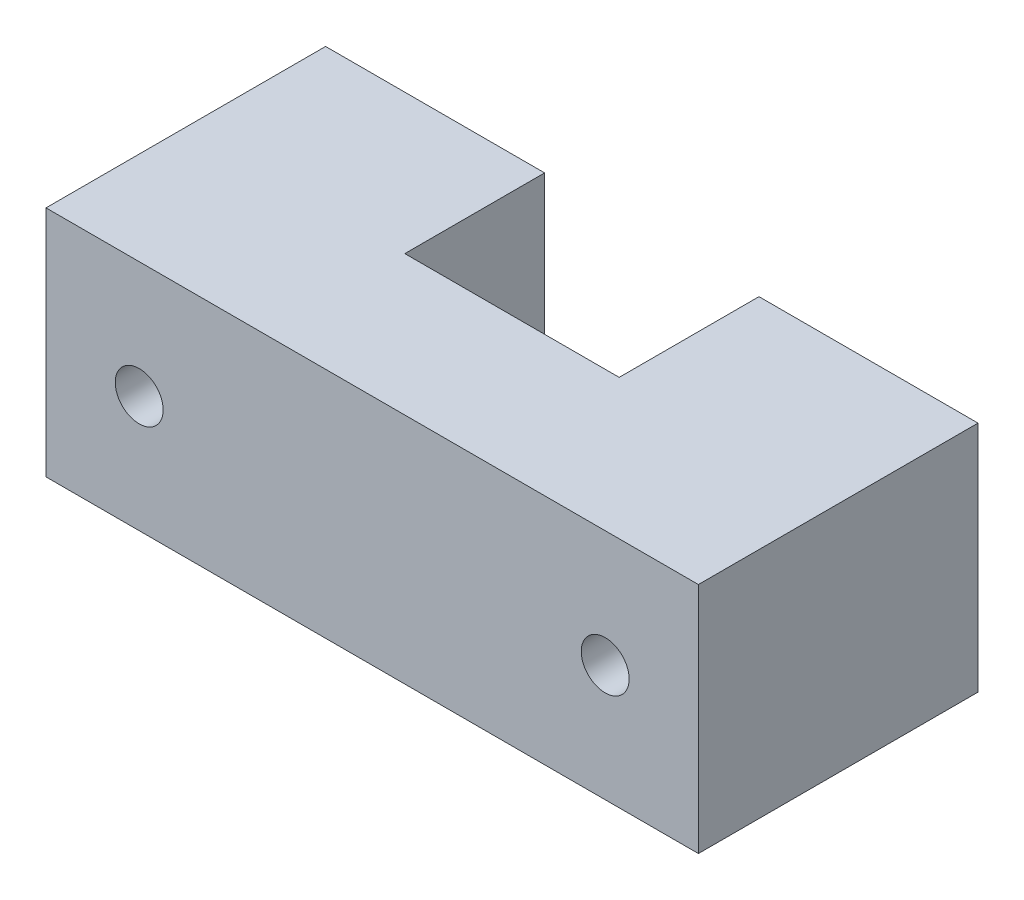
from build123d import *

# Parameters (mm, degrees)
SKETCH1_W               = 88.9
SKETCH1_H               = 31.75
BOSS_EXTRUDE1_DEPTH     = 38.1
F_1_4_CLEARANCE_HOLE1_D = 6.5278
SKETCH4_W               = 29.21
SKETCH4_H               = 19.05
CUT_EXTRUDE1_DEPTH      = 67.599361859


with BuildPart() as part:
    # Sketch1 → Boss-Extrude1 (new body)
    with BuildSketch(Plane.XY):
        Rectangle(SKETCH1_W, SKETCH1_H)
    extrude(amount=BOSS_EXTRUDE1_DEPTH)

    # 1_4 Clearance Hole1 (through all)
    with Locations(Plane.XY.offset(38.1)):
        with Locations((-31.75, 0), (31.75, 0)):
            Hole(F_1_4_CLEARANCE_HOLE1_D / 2)

    # Sketch4 → Cut-Extrude1 (cut, through all)
    with BuildSketch(Plane(origin=(0, 15.875, 0), x_dir=(1, 0, 0), z_dir=(0, 1, 0))):
        with Locations((0, -9.525)):
            Rectangle(SKETCH4_W, SKETCH4_H)
    extrude(amount=-CUT_EXTRUDE1_DEPTH, mode=Mode.SUBTRACT)


solid = part.part
